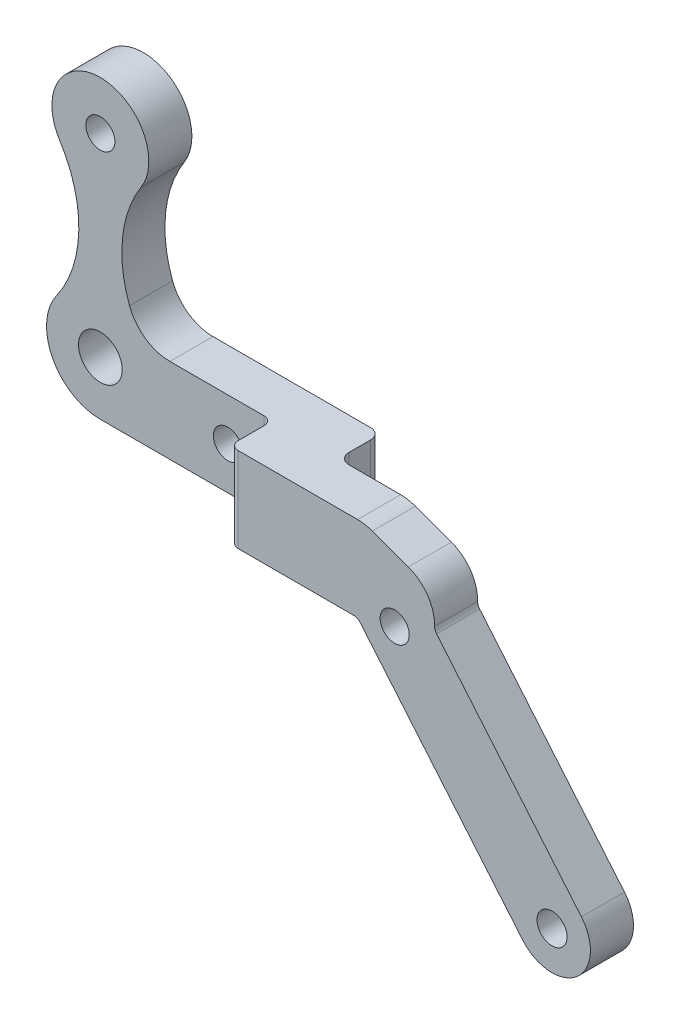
ISO-10303-21;
HEADER;
FILE_DESCRIPTION(('STEP AP214'),'2;1');
FILE_NAME('part.step','',(''),(''),'','','');
FILE_SCHEMA(('AUTOMOTIVE_DESIGN { 1 0 10303 214 1 1 1 1 }'));
ENDSEC;
DATA;
#1=APPLICATION_CONTEXT('core data for automotive mechanical design processes');
#2=APPLICATION_PROTOCOL_DEFINITION('international standard','automotive_design',2000,#1);
#3=PRODUCT_CONTEXT('',#1,'mechanical');
#4=PRODUCT('Part','Part','',(#3));
#5=PRODUCT_RELATED_PRODUCT_CATEGORY('part','',(#4));
#6=PRODUCT_DEFINITION_FORMATION('','',#4);
#7=PRODUCT_DEFINITION_CONTEXT('part definition',#1,'design');
#8=PRODUCT_DEFINITION('design','',#6,#7);
#9=PRODUCT_DEFINITION_SHAPE('','',#8);
#10=(LENGTH_UNIT() NAMED_UNIT(*) SI_UNIT(.MILLI.,.METRE.));
#11=(NAMED_UNIT(*) PLANE_ANGLE_UNIT() SI_UNIT($,.RADIAN.));
#12=(NAMED_UNIT(*) SI_UNIT($,.STERADIAN.) SOLID_ANGLE_UNIT());
#13=UNCERTAINTY_MEASURE_WITH_UNIT(LENGTH_MEASURE(1.E-05),#10,'distance_accuracy_value','');
#14=(GEOMETRIC_REPRESENTATION_CONTEXT(3) GLOBAL_UNCERTAINTY_ASSIGNED_CONTEXT((#13)) GLOBAL_UNIT_ASSIGNED_CONTEXT((#10,
#11,#12)) REPRESENTATION_CONTEXT('',''));
#15=CARTESIAN_POINT('',(0.,0.,0.));
#16=DIRECTION('',(0.,0.,1.));
#17=DIRECTION('',(1.,0.,0.));
#18=AXIS2_PLACEMENT_3D('',#15,#16,#17);
#19=CARTESIAN_POINT('',(16.9667619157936,11.9984192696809,7.62));
#20=DIRECTION('',(0.,0.,-1.));
#21=DIRECTION('',(1.,0.,0.));
#22=AXIS2_PLACEMENT_3D('',#19,#20,#21);
#23=PLANE('',#22);
#24=CARTESIAN_POINT('',(0.,0.,7.62));
#25=DIRECTION('',(0.,0.,1.));
#26=DIRECTION('',(1.,0.,0.));
#27=AXIS2_PLACEMENT_3D('',#24,#25,#26);
#28=CIRCLE('',#27,2.5781);
#29=CARTESIAN_POINT('',(2.5781,0.,7.62));
#30=VERTEX_POINT('',#29);
#31=EDGE_CURVE('E227',#30,#30,#28,.T.);
#32=ORIENTED_EDGE('',*,*,#31,.F.);
#33=EDGE_LOOP('',(#32));
#34=FACE_BOUND('',#33,.T.);
#35=CARTESIAN_POINT('',(15.042758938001,-1.34180015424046,7.62));
#36=DIRECTION('',(0.,0.,1.));
#37=DIRECTION('',(1.,0.,0.));
#38=AXIS2_PLACEMENT_3D('',#35,#36,#37);
#39=CIRCLE('',#38,1.7145);
#40=CARTESIAN_POINT('',(16.757258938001,-1.34180015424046,7.62));
#41=VERTEX_POINT('',#40);
#42=EDGE_CURVE('E234',#41,#41,#39,.T.);
#43=ORIENTED_EDGE('',*,*,#42,.F.);
#44=EDGE_LOOP('',(#43));
#45=FACE_BOUND('',#44,.T.);
#46=CARTESIAN_POINT('',(0.,22.86,7.62));
#47=DIRECTION('',(0.,0.,1.));
#48=DIRECTION('',(1.,0.,0.));
#49=AXIS2_PLACEMENT_3D('',#46,#47,#48);
#50=CIRCLE('',#49,1.7145);
#51=CARTESIAN_POINT('',(1.7145,22.86,7.62));
#52=VERTEX_POINT('',#51);
#53=EDGE_CURVE('E271',#52,#52,#50,.T.);
#54=ORIENTED_EDGE('',*,*,#53,.F.);
#55=EDGE_LOOP('',(#54));
#56=FACE_BOUND('',#55,.T.);
#57=DIRECTION('',(-1.,0.,0.));
#58=VECTOR('',#57,1.);
#59=CARTESIAN_POINT('',(5.18459384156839,3.66639969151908,7.62));
#60=LINE('',#59,#58);
#61=CARTESIAN_POINT('',(19.304,3.66639969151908,7.62));
#62=VERTEX_POINT('',#61);
#63=CARTESIAN_POINT('',(8.19989409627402,3.66639969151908,7.62));
#64=VERTEX_POINT('',#63);
#65=EDGE_CURVE('E281',#62,#64,#60,.T.);
#66=ORIENTED_EDGE('',*,*,#65,.T.);
#67=CARTESIAN_POINT('',(8.19989409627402,8.74639969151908,7.62));
#68=DIRECTION('',(0.,0.,1.));
#69=DIRECTION('',(1.,0.,0.));
#70=AXIS2_PLACEMENT_3D('',#67,#68,#69);
#71=CIRCLE('',#70,5.08);
#72=CARTESIAN_POINT('',(3.43702128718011,6.97963920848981,7.62));
#73=VERTEX_POINT('',#72);
#74=EDGE_CURVE('E330',#73,#64,#71,.T.);
#75=ORIENTED_EDGE('',*,*,#74,.F.);
#76=CARTESIAN_POINT('',(16.9667619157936,11.9984192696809,7.62));
#77=DIRECTION('',(0.,0.,-1.));
#78=DIRECTION('',(1.,0.,0.));
#79=AXIS2_PLACEMENT_3D('',#76,#77,#78);
#80=CIRCLE('',#79,14.4305937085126);
#81=CARTESIAN_POINT('',(4.81321353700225,19.77873395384,7.62));
#82=VERTEX_POINT('',#81);
#83=EDGE_CURVE('E274',#73,#82,#80,.T.);
#84=ORIENTED_EDGE('',*,*,#83,.T.);
#85=CARTESIAN_POINT('',(0.,22.86,7.62));
#86=DIRECTION('',(0.,0.,1.));
#87=DIRECTION('',(1.,0.,0.));
#88=AXIS2_PLACEMENT_3D('',#85,#86,#87);
#89=CIRCLE('',#88,5.715);
#90=CARTESIAN_POINT('',(-4.81321353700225,19.77873395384,7.62));
#91=VERTEX_POINT('',#90);
#92=EDGE_CURVE('E298',#82,#91,#89,.T.);
#93=ORIENTED_EDGE('',*,*,#92,.T.);
#94=CARTESIAN_POINT('',(-16.9667619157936,11.9984192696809,7.62));
#95=DIRECTION('',(0.,0.,-1.));
#96=DIRECTION('',(-1.,0.,0.));
#97=AXIS2_PLACEMENT_3D('',#94,#95,#96);
#98=CIRCLE('',#97,14.4305937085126);
#99=CARTESIAN_POINT('',(-5.18459384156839,3.66639969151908,7.62));
#100=VERTEX_POINT('',#99);
#101=EDGE_CURVE('E301',#91,#100,#98,.T.);
#102=ORIENTED_EDGE('',*,*,#101,.T.);
#103=CARTESIAN_POINT('',(0.,0.,7.62));
#104=DIRECTION('',(0.,0.,1.));
#105=DIRECTION('',(1.,0.,0.));
#106=AXIS2_PLACEMENT_3D('',#103,#104,#105);
#107=CIRCLE('',#106,6.35);
#108=CARTESIAN_POINT('',(0.,-6.35,7.62));
#109=VERTEX_POINT('',#108);
#110=EDGE_CURVE('E304',#100,#109,#107,.T.);
#111=ORIENTED_EDGE('',*,*,#110,.T.);
#112=DIRECTION('',(1.,0.,0.));
#113=VECTOR('',#112,1.);
#114=CARTESIAN_POINT('',(36.322,-6.35,7.62));
#115=LINE('',#114,#113);
#116=CARTESIAN_POINT('',(19.304,-6.35,7.62));
#117=VERTEX_POINT('',#116);
#118=EDGE_CURVE('E307',#109,#117,#115,.T.);
#119=ORIENTED_EDGE('',*,*,#118,.T.);
#120=DIRECTION('',(0.,-1.,0.));
#121=VECTOR('',#120,1.);
#122=CARTESIAN_POINT('',(19.304,11.9984192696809,7.62));
#123=LINE('',#122,#121);
#124=EDGE_CURVE('E347',#62,#117,#123,.T.);
#125=ORIENTED_EDGE('',*,*,#124,.F.);
#126=EDGE_LOOP('',(#66,#75,#84,#93,#102,#111,#119,#125));
#127=FACE_BOUND('',#126,.T.);
#128=ADVANCED_FACE('F35',(#34,#45,#56,#127),#23,.F.);
#129=CARTESIAN_POINT('',(16.9667619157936,11.9984192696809,2.54));
#130=DIRECTION('',(0.,0.,1.));
#131=DIRECTION('',(-1.,0.,0.));
#132=AXIS2_PLACEMENT_3D('',#129,#130,#131);
#133=CYLINDRICAL_SURFACE('',#132,14.4305937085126);
#134=CARTESIAN_POINT('',(16.9667619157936,11.9984192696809,2.54));
#135=DIRECTION('',(0.,0.,-1.));
#136=DIRECTION('',(1.,0.,0.));
#137=AXIS2_PLACEMENT_3D('',#134,#135,#136);
#138=CIRCLE('',#137,14.4305937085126);
#139=CARTESIAN_POINT('',(3.43702128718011,6.97963920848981,2.54));
#140=VERTEX_POINT('',#139);
#141=CARTESIAN_POINT('',(4.81321353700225,19.77873395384,2.54));
#142=VERTEX_POINT('',#141);
#143=EDGE_CURVE('E277',#140,#142,#138,.T.);
#144=ORIENTED_EDGE('',*,*,#143,.T.);
#145=DIRECTION('',(0.,0.,1.));
#146=VECTOR('',#145,1.);
#147=CARTESIAN_POINT('',(4.81321353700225,19.77873395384,2.54));
#148=LINE('',#147,#146);
#149=EDGE_CURVE('E317',#142,#82,#148,.T.);
#150=ORIENTED_EDGE('',*,*,#149,.T.);
#151=ORIENTED_EDGE('',*,*,#83,.F.);
#152=DIRECTION('',(0.,0.,1.));
#153=VECTOR('',#152,1.);
#154=CARTESIAN_POINT('',(3.4370212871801,6.97963920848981,2.54));
#155=LINE('',#154,#153);
#156=EDGE_CURVE('E319',#140,#73,#155,.T.);
#157=ORIENTED_EDGE('',*,*,#156,.F.);
#158=EDGE_LOOP('',(#144,#150,#151,#157));
#159=FACE_BOUND('',#158,.T.);
#160=ADVANCED_FACE('F458',(#159),#133,.F.);
#161=CARTESIAN_POINT('',(0.,22.86,2.54));
#162=DIRECTION('',(0.,0.,1.));
#163=DIRECTION('',(-1.,0.,0.));
#164=AXIS2_PLACEMENT_3D('',#161,#162,#163);
#165=CYLINDRICAL_SURFACE('',#164,5.715);
#166=ORIENTED_EDGE('',*,*,#92,.F.);
#167=ORIENTED_EDGE('',*,*,#149,.F.);
#168=CARTESIAN_POINT('',(0.,22.86,2.54));
#169=DIRECTION('',(0.,0.,1.));
#170=DIRECTION('',(1.,0.,0.));
#171=AXIS2_PLACEMENT_3D('',#168,#169,#170);
#172=CIRCLE('',#171,5.715);
#173=CARTESIAN_POINT('',(-4.81321353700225,19.77873395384,2.54));
#174=VERTEX_POINT('',#173);
#175=EDGE_CURVE('E280',#142,#174,#172,.T.);
#176=ORIENTED_EDGE('',*,*,#175,.T.);
#177=DIRECTION('',(0.,0.,1.));
#178=VECTOR('',#177,1.);
#179=CARTESIAN_POINT('',(-4.81321353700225,19.77873395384,2.54));
#180=LINE('',#179,#178);
#181=EDGE_CURVE('E315',#174,#91,#180,.T.);
#182=ORIENTED_EDGE('',*,*,#181,.T.);
#183=EDGE_LOOP('',(#166,#167,#176,#182));
#184=FACE_BOUND('',#183,.T.);
#185=ADVANCED_FACE('F464',(#184),#165,.T.);
#186=CARTESIAN_POINT('',(-16.9667619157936,11.9984192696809,2.54));
#187=DIRECTION('',(0.,0.,1.));
#188=DIRECTION('',(-1.,0.,0.));
#189=AXIS2_PLACEMENT_3D('',#186,#187,#188);
#190=CYLINDRICAL_SURFACE('',#189,14.4305937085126);
#191=ORIENTED_EDGE('',*,*,#101,.F.);
#192=ORIENTED_EDGE('',*,*,#181,.F.);
#193=CARTESIAN_POINT('',(-16.9667619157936,11.9984192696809,2.54));
#194=DIRECTION('',(0.,0.,-1.));
#195=DIRECTION('',(-1.,0.,0.));
#196=AXIS2_PLACEMENT_3D('',#193,#194,#195);
#197=CIRCLE('',#196,14.4305937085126);
#198=CARTESIAN_POINT('',(-5.18459384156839,3.66639969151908,2.54));
#199=VERTEX_POINT('',#198);
#200=EDGE_CURVE('E284',#174,#199,#197,.T.);
#201=ORIENTED_EDGE('',*,*,#200,.T.);
#202=DIRECTION('',(0.,0.,1.));
#203=VECTOR('',#202,1.);
#204=CARTESIAN_POINT('',(-5.18459384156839,3.66639969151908,2.54));
#205=LINE('',#204,#203);
#206=EDGE_CURVE('E313',#199,#100,#205,.T.);
#207=ORIENTED_EDGE('',*,*,#206,.T.);
#208=EDGE_LOOP('',(#191,#192,#201,#207));
#209=FACE_BOUND('',#208,.T.);
#210=ADVANCED_FACE('F482',(#209),#190,.F.);
#211=CARTESIAN_POINT('',(0.,0.,2.54));
#212=DIRECTION('',(0.,0.,1.));
#213=DIRECTION('',(-1.,0.,0.));
#214=AXIS2_PLACEMENT_3D('',#211,#212,#213);
#215=CYLINDRICAL_SURFACE('',#214,6.35);
#216=ORIENTED_EDGE('',*,*,#110,.F.);
#217=ORIENTED_EDGE('',*,*,#206,.F.);
#218=CARTESIAN_POINT('',(0.,0.,2.54));
#219=DIRECTION('',(0.,0.,1.));
#220=DIRECTION('',(1.,0.,0.));
#221=AXIS2_PLACEMENT_3D('',#218,#219,#220);
#222=CIRCLE('',#221,6.35);
#223=CARTESIAN_POINT('',(0.,-6.35,2.54));
#224=VERTEX_POINT('',#223);
#225=EDGE_CURVE('E287',#199,#224,#222,.T.);
#226=ORIENTED_EDGE('',*,*,#225,.T.);
#227=DIRECTION('',(0.,0.,1.));
#228=VECTOR('',#227,1.);
#229=CARTESIAN_POINT('',(0.,-6.35,2.54));
#230=LINE('',#229,#228);
#231=EDGE_CURVE('E295',#224,#109,#230,.T.);
#232=ORIENTED_EDGE('',*,*,#231,.T.);
#233=EDGE_LOOP('',(#216,#217,#226,#232));
#234=FACE_BOUND('',#233,.T.);
#235=ADVANCED_FACE('F447',(#234),#215,.T.);
#236=CARTESIAN_POINT('',(36.322,-6.35,2.54));
#237=DIRECTION('',(0.,1.,0.));
#238=DIRECTION('',(-1.,0.,0.));
#239=AXIS2_PLACEMENT_3D('',#236,#237,#238);
#240=PLANE('',#239);
#241=DIRECTION('',(1.,0.,0.));
#242=VECTOR('',#241,1.);
#243=CARTESIAN_POINT('',(36.322,-6.35,2.54));
#244=LINE('',#243,#242);
#245=CARTESIAN_POINT('',(26.790258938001,-6.35,2.54));
#246=VERTEX_POINT('',#245);
#247=EDGE_CURVE('E290',#224,#246,#244,.T.);
#248=ORIENTED_EDGE('',*,*,#247,.T.);
#249=CARTESIAN_POINT('',(26.790258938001,-6.34999999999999,3.81));
#250=DIRECTION('',(0.,1.,0.));
#251=DIRECTION('',(-1.,0.,0.));
#252=AXIS2_PLACEMENT_3D('',#249,#250,#251);
#253=CIRCLE('',#252,1.27);
#254=CARTESIAN_POINT('',(28.060258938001,-6.35,3.81));
#255=VERTEX_POINT('',#254);
#256=EDGE_CURVE('E58',#246,#255,#253,.F.);
#257=ORIENTED_EDGE('',*,*,#256,.T.);
#258=DIRECTION('',(0.,0.,-1.));
#259=VECTOR('',#258,1.);
#260=CARTESIAN_POINT('',(28.060258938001,-6.35,18.8509689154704));
#261=LINE('',#260,#259);
#262=CARTESIAN_POINT('',(28.060258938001,-6.35,6.35));
#263=VERTEX_POINT('',#262);
#264=EDGE_CURVE('E391',#263,#255,#261,.T.);
#265=ORIENTED_EDGE('',*,*,#264,.F.);
#266=CARTESIAN_POINT('',(29.330258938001,-6.35,6.35));
#267=DIRECTION('',(0.,1.,0.));
#268=DIRECTION('',(-1.,0.,0.));
#269=AXIS2_PLACEMENT_3D('',#266,#267,#268);
#270=CIRCLE('',#269,1.27);
#271=CARTESIAN_POINT('',(29.330258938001,-6.35,7.62));
#272=VERTEX_POINT('',#271);
#273=EDGE_CURVE('E43',#263,#272,#270,.T.);
#274=ORIENTED_EDGE('',*,*,#273,.T.);
#275=DIRECTION('',(-1.,0.,0.));
#276=VECTOR('',#275,1.);
#277=CARTESIAN_POINT('',(23.996258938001,-6.34999999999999,7.62));
#278=LINE('',#277,#276);
#279=CARTESIAN_POINT('',(34.9524903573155,-6.35,7.62));
#280=VERTEX_POINT('',#279);
#281=EDGE_CURVE('E250',#280,#272,#278,.T.);
#282=ORIENTED_EDGE('',*,*,#281,.F.);
#283=DIRECTION('',(0.,0.,-1.));
#284=VECTOR('',#283,1.);
#285=CARTESIAN_POINT('',(34.9524903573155,-6.35,2.54));
#286=LINE('',#285,#284);
#287=CARTESIAN_POINT('',(34.9524903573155,-6.35,12.7));
#288=VERTEX_POINT('',#287);
#289=EDGE_CURVE('E365',#280,#288,#286,.F.);
#290=ORIENTED_EDGE('',*,*,#289,.T.);
#291=DIRECTION('',(1.,0.,0.));
#292=VECTOR('',#291,1.);
#293=CARTESIAN_POINT('',(20.32,-6.35,12.7));
#294=LINE('',#293,#292);
#295=CARTESIAN_POINT('',(21.336,-6.35,12.7));
#296=VERTEX_POINT('',#295);
#297=EDGE_CURVE('E259',#296,#288,#294,.T.);
#298=ORIENTED_EDGE('',*,*,#297,.F.);
#299=CARTESIAN_POINT('',(21.336,-6.35,11.684));
#300=DIRECTION('',(0.,-1.,0.));
#301=DIRECTION('',(-1.,0.,0.));
#302=AXIS2_PLACEMENT_3D('',#299,#300,#301);
#303=CIRCLE('',#302,1.016);
#304=CARTESIAN_POINT('',(20.32,-6.35,11.684));
#305=VERTEX_POINT('',#304);
#306=EDGE_CURVE('E338',#305,#296,#303,.F.);
#307=ORIENTED_EDGE('',*,*,#306,.F.);
#308=DIRECTION('',(0.,0.,-1.));
#309=VECTOR('',#308,1.);
#310=CARTESIAN_POINT('',(20.32,-6.35,12.7));
#311=LINE('',#310,#309);
#312=CARTESIAN_POINT('',(20.32,-6.35,8.636));
#313=VERTEX_POINT('',#312);
#314=EDGE_CURVE('E264',#305,#313,#311,.T.);
#315=ORIENTED_EDGE('',*,*,#314,.T.);
#316=CARTESIAN_POINT('',(19.304,-6.34999999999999,8.636));
#317=DIRECTION('',(0.,-1.,0.));
#318=DIRECTION('',(-1.,0.,0.));
#319=AXIS2_PLACEMENT_3D('',#316,#317,#318);
#320=CIRCLE('',#319,1.016);
#321=EDGE_CURVE('E350',#117,#313,#320,.T.);
#322=ORIENTED_EDGE('',*,*,#321,.F.);
#323=ORIENTED_EDGE('',*,*,#118,.F.);
#324=ORIENTED_EDGE('',*,*,#231,.F.);
#325=EDGE_LOOP('',(#248,#257,#265,#274,#282,#290,#298,#307,#315,#322,#323,#324));
#326=FACE_BOUND('',#325,.T.);
#327=ADVANCED_FACE('F388',(#326),#240,.F.);
#328=CARTESIAN_POINT('',(36.322,3.66639969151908,2.54));
#329=DIRECTION('',(-0.34202014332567,-0.939692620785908,0.));
#330=DIRECTION('',(0.939692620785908,-0.34202014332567,0.));
#331=AXIS2_PLACEMENT_3D('',#328,#329,#330);
#332=PLANE('',#331);
#333=DIRECTION('',(0.,0.,1.));
#334=VECTOR('',#333,1.);
#335=CARTESIAN_POINT('',(41.4054965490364,1.81615826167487,2.54));
#336=LINE('',#335,#334);
#337=CARTESIAN_POINT('',(41.4054965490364,1.81615826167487,7.62));
#338=VERTEX_POINT('',#337);
#339=CARTESIAN_POINT('',(41.4054965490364,1.81615826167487,12.7));
#340=VERTEX_POINT('',#339);
#341=EDGE_CURVE('E240',#338,#340,#336,.T.);
#342=ORIENTED_EDGE('',*,*,#341,.F.);
#343=DIRECTION('',(0.939692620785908,-0.34202014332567,0.));
#344=VECTOR('',#343,1.);
#345=CARTESIAN_POINT('',(58.1132313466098,-4.26495988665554,7.62));
#346=LINE('',#345,#344);
#347=CARTESIAN_POINT('',(37.1637212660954,3.36003820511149,7.62));
#348=VERTEX_POINT('',#347);
#349=EDGE_CURVE('E247',#348,#338,#346,.T.);
#350=ORIENTED_EDGE('',*,*,#349,.F.);
#351=DIRECTION('',(0.,0.,1.));
#352=VECTOR('',#351,1.);
#353=CARTESIAN_POINT('',(37.1637212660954,3.36003820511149,2.54));
#354=LINE('',#353,#352);
#355=CARTESIAN_POINT('',(37.1637212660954,3.36003820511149,12.7));
#356=VERTEX_POINT('',#355);
#357=EDGE_CURVE('E327',#356,#348,#354,.F.);
#358=ORIENTED_EDGE('',*,*,#357,.F.);
#359=DIRECTION('',(0.939692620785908,-0.34202014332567,0.));
#360=VECTOR('',#359,1.);
#361=CARTESIAN_POINT('',(37.1637212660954,3.36003820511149,12.7));
#362=LINE('',#361,#360);
#363=EDGE_CURVE('E257',#356,#340,#362,.T.);
#364=ORIENTED_EDGE('',*,*,#363,.T.);
#365=EDGE_LOOP('',(#342,#350,#358,#364));
#366=FACE_BOUND('',#365,.T.);
#367=ADVANCED_FACE('F474',(#366),#332,.F.);
#368=CARTESIAN_POINT('',(5.18459384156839,3.66639969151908,2.54));
#369=DIRECTION('',(0.,-1.,0.));
#370=DIRECTION('',(0.,0.,1.));
#371=AXIS2_PLACEMENT_3D('',#368,#369,#370);
#372=PLANE('',#371);
#373=DIRECTION('',(0.,0.,-1.));
#374=VECTOR('',#373,1.);
#375=CARTESIAN_POINT('',(28.060258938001,3.66639969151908,18.8509689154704));
#376=LINE('',#375,#374);
#377=CARTESIAN_POINT('',(28.060258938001,3.66639969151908,6.35));
#378=VERTEX_POINT('',#377);
#379=CARTESIAN_POINT('',(28.060258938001,3.66639969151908,3.81));
#380=VERTEX_POINT('',#379);
#381=EDGE_CURVE('E404',#378,#380,#376,.T.);
#382=ORIENTED_EDGE('',*,*,#381,.T.);
#383=CARTESIAN_POINT('',(26.790258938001,3.66639969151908,3.81));
#384=DIRECTION('',(0.,-1.,0.));
#385=DIRECTION('',(0.,0.,-1.));
#386=AXIS2_PLACEMENT_3D('',#383,#384,#385);
#387=CIRCLE('',#386,1.27);
#388=CARTESIAN_POINT('',(26.790258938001,3.66639969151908,2.54));
#389=VERTEX_POINT('',#388);
#390=EDGE_CURVE('E50',#380,#389,#387,.F.);
#391=ORIENTED_EDGE('',*,*,#390,.T.);
#392=DIRECTION('',(-1.,0.,0.));
#393=VECTOR('',#392,1.);
#394=CARTESIAN_POINT('',(5.18459384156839,3.66639969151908,2.54));
#395=LINE('',#394,#393);
#396=CARTESIAN_POINT('',(8.19989409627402,3.66639969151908,2.54));
#397=VERTEX_POINT('',#396);
#398=EDGE_CURVE('E293',#389,#397,#395,.T.);
#399=ORIENTED_EDGE('',*,*,#398,.T.);
#400=DIRECTION('',(0.,0.,-1.));
#401=VECTOR('',#400,1.);
#402=CARTESIAN_POINT('',(8.19989409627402,3.66639969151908,2.54));
#403=LINE('',#402,#401);
#404=EDGE_CURVE('E324',#64,#397,#403,.T.);
#405=ORIENTED_EDGE('',*,*,#404,.F.);
#406=ORIENTED_EDGE('',*,*,#65,.F.);
#407=CARTESIAN_POINT('',(19.304,3.66639969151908,8.636));
#408=DIRECTION('',(0.,1.,0.));
#409=DIRECTION('',(0.,0.,1.));
#410=AXIS2_PLACEMENT_3D('',#407,#408,#409);
#411=CIRCLE('',#410,1.016);
#412=CARTESIAN_POINT('',(20.32,3.66639969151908,8.636));
#413=VERTEX_POINT('',#412);
#414=EDGE_CURVE('E353',#413,#62,#411,.T.);
#415=ORIENTED_EDGE('',*,*,#414,.F.);
#416=DIRECTION('',(0.,0.,-1.));
#417=VECTOR('',#416,1.);
#418=CARTESIAN_POINT('',(20.32,3.66639969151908,12.7));
#419=LINE('',#418,#417);
#420=CARTESIAN_POINT('',(20.32,3.66639969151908,11.684));
#421=VERTEX_POINT('',#420);
#422=EDGE_CURVE('E265',#421,#413,#419,.T.);
#423=ORIENTED_EDGE('',*,*,#422,.F.);
#424=CARTESIAN_POINT('',(21.336,3.66639969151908,11.684));
#425=DIRECTION('',(0.,1.,0.));
#426=DIRECTION('',(0.,0.,1.));
#427=AXIS2_PLACEMENT_3D('',#424,#425,#426);
#428=CIRCLE('',#427,1.016);
#429=CARTESIAN_POINT('',(21.336,3.66639969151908,12.7));
#430=VERTEX_POINT('',#429);
#431=EDGE_CURVE('E335',#430,#421,#428,.F.);
#432=ORIENTED_EDGE('',*,*,#431,.F.);
#433=DIRECTION('',(-1.,0.,0.));
#434=VECTOR('',#433,1.);
#435=CARTESIAN_POINT('',(20.32,3.66639969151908,12.7));
#436=LINE('',#435,#434);
#437=CARTESIAN_POINT('',(35.426258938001,3.66639969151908,12.7));
#438=VERTEX_POINT('',#437);
#439=EDGE_CURVE('E261',#438,#430,#436,.T.);
#440=ORIENTED_EDGE('',*,*,#439,.F.);
#441=DIRECTION('',(0.,0.,1.));
#442=VECTOR('',#441,1.);
#443=CARTESIAN_POINT('',(35.426258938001,3.66639969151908,2.54));
#444=LINE('',#443,#442);
#445=CARTESIAN_POINT('',(35.426258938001,3.66639969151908,7.62));
#446=VERTEX_POINT('',#445);
#447=EDGE_CURVE('E321',#446,#438,#444,.T.);
#448=ORIENTED_EDGE('',*,*,#447,.F.);
#449=DIRECTION('',(1.,0.,0.));
#450=VECTOR('',#449,1.);
#451=CARTESIAN_POINT('',(35.426258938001,3.66639969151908,7.62));
#452=LINE('',#451,#450);
#453=CARTESIAN_POINT('',(29.330258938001,3.66639969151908,7.62));
#454=VERTEX_POINT('',#453);
#455=EDGE_CURVE('E253',#454,#446,#452,.T.);
#456=ORIENTED_EDGE('',*,*,#455,.F.);
#457=CARTESIAN_POINT('',(29.330258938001,3.66639969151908,6.35));
#458=DIRECTION('',(0.,-1.,0.));
#459=DIRECTION('',(0.,0.,-1.));
#460=AXIS2_PLACEMENT_3D('',#457,#458,#459);
#461=CIRCLE('',#460,1.27);
#462=EDGE_CURVE('E11',#454,#378,#461,.T.);
#463=ORIENTED_EDGE('',*,*,#462,.T.);
#464=EDGE_LOOP('',(#382,#391,#399,#405,#406,#415,#423,#432,#440,#448,#456,#463));
#465=FACE_BOUND('',#464,.T.);
#466=ADVANCED_FACE('F403',(#465),#372,.F.);
#467=CARTESIAN_POINT('',(16.9667619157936,11.9984192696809,2.54));
#468=DIRECTION('',(0.,0.,-1.));
#469=DIRECTION('',(1.,0.,0.));
#470=AXIS2_PLACEMENT_3D('',#467,#468,#469);
#471=PLANE('',#470);
#472=CARTESIAN_POINT('',(0.,0.,2.54));
#473=DIRECTION('',(0.,0.,1.));
#474=DIRECTION('',(1.,0.,0.));
#475=AXIS2_PLACEMENT_3D('',#472,#473,#474);
#476=CIRCLE('',#475,2.5781);
#477=CARTESIAN_POINT('',(2.5781,0.,2.54));
#478=VERTEX_POINT('',#477);
#479=EDGE_CURVE('E224',#478,#478,#476,.T.);
#480=ORIENTED_EDGE('',*,*,#479,.T.);
#481=EDGE_LOOP('',(#480));
#482=FACE_BOUND('',#481,.T.);
#483=CARTESIAN_POINT('',(15.042758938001,-1.34180015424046,2.54));
#484=DIRECTION('',(0.,0.,1.));
#485=DIRECTION('',(1.,0.,0.));
#486=AXIS2_PLACEMENT_3D('',#483,#484,#485);
#487=CIRCLE('',#486,1.7145);
#488=CARTESIAN_POINT('',(16.757258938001,-1.34180015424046,2.54));
#489=VERTEX_POINT('',#488);
#490=EDGE_CURVE('E231',#489,#489,#487,.T.);
#491=ORIENTED_EDGE('',*,*,#490,.T.);
#492=EDGE_LOOP('',(#491));
#493=FACE_BOUND('',#492,.T.);
#494=ORIENTED_EDGE('',*,*,#398,.F.);
#495=DIRECTION('',(0.,-1.,0.));
#496=VECTOR('',#495,1.);
#497=CARTESIAN_POINT('',(26.790258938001,11.9984192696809,2.54));
#498=LINE('',#497,#496);
#499=EDGE_CURVE('E382',#389,#246,#498,.T.);
#500=ORIENTED_EDGE('',*,*,#499,.T.);
#501=ORIENTED_EDGE('',*,*,#247,.F.);
#502=ORIENTED_EDGE('',*,*,#225,.F.);
#503=ORIENTED_EDGE('',*,*,#200,.F.);
#504=ORIENTED_EDGE('',*,*,#175,.F.);
#505=ORIENTED_EDGE('',*,*,#143,.F.);
#506=CARTESIAN_POINT('',(8.19989409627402,8.74639969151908,2.54));
#507=DIRECTION('',(0.,0.,1.));
#508=DIRECTION('',(1.,0.,0.));
#509=AXIS2_PLACEMENT_3D('',#506,#507,#508);
#510=CIRCLE('',#509,5.08);
#511=EDGE_CURVE('E333',#397,#140,#510,.F.);
#512=ORIENTED_EDGE('',*,*,#511,.F.);
#513=EDGE_LOOP('',(#494,#500,#501,#502,#503,#504,#505,#512));
#514=FACE_BOUND('',#513,.T.);
#515=CARTESIAN_POINT('',(0.,22.86,2.54));
#516=DIRECTION('',(0.,0.,1.));
#517=DIRECTION('',(1.,0.,0.));
#518=AXIS2_PLACEMENT_3D('',#515,#516,#517);
#519=CIRCLE('',#518,1.7145);
#520=CARTESIAN_POINT('',(1.7145,22.86,2.54));
#521=VERTEX_POINT('',#520);
#522=EDGE_CURVE('E268',#521,#521,#519,.T.);
#523=ORIENTED_EDGE('',*,*,#522,.T.);
#524=EDGE_LOOP('',(#523));
#525=FACE_BOUND('',#524,.T.);
#526=ADVANCED_FACE('F449',(#482,#493,#514,#525),#471,.T.);
#527=CARTESIAN_POINT('',(8.19989409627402,8.74639969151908,2.54));
#528=DIRECTION('',(0.,0.,1.));
#529=DIRECTION('',(-1.,0.,0.));
#530=AXIS2_PLACEMENT_3D('',#527,#528,#529);
#531=CYLINDRICAL_SURFACE('',#530,5.08);
#532=ORIENTED_EDGE('',*,*,#511,.T.);
#533=ORIENTED_EDGE('',*,*,#156,.T.);
#534=ORIENTED_EDGE('',*,*,#74,.T.);
#535=ORIENTED_EDGE('',*,*,#404,.T.);
#536=EDGE_LOOP('',(#532,#533,#534,#535));
#537=FACE_BOUND('',#536,.T.);
#538=ADVANCED_FACE('F489',(#537),#531,.F.);
#539=CARTESIAN_POINT('',(35.426258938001,-1.41360030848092,2.54));
#540=DIRECTION('',(0.,0.,1.));
#541=DIRECTION('',(-1.,0.,0.));
#542=AXIS2_PLACEMENT_3D('',#539,#540,#541);
#543=CYLINDRICAL_SURFACE('',#542,5.08);
#544=CARTESIAN_POINT('',(35.426258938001,-1.41360030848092,7.62));
#545=DIRECTION('',(0.,0.,-1.));
#546=DIRECTION('',(-1.,0.,0.));
#547=AXIS2_PLACEMENT_3D('',#544,#545,#546);
#548=CIRCLE('',#547,5.08);
#549=EDGE_CURVE('E245',#446,#348,#548,.T.);
#550=ORIENTED_EDGE('',*,*,#549,.F.);
#551=ORIENTED_EDGE('',*,*,#447,.T.);
#552=CARTESIAN_POINT('',(35.426258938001,-1.41360030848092,12.7));
#553=DIRECTION('',(0.,0.,-1.));
#554=DIRECTION('',(-1.,0.,0.));
#555=AXIS2_PLACEMENT_3D('',#552,#553,#554);
#556=CIRCLE('',#555,5.08);
#557=EDGE_CURVE('E255',#438,#356,#556,.T.);
#558=ORIENTED_EDGE('',*,*,#557,.T.);
#559=ORIENTED_EDGE('',*,*,#357,.T.);
#560=EDGE_LOOP('',(#550,#551,#558,#559));
#561=FACE_BOUND('',#560,.T.);
#562=ADVANCED_FACE('F492',(#561),#543,.T.);
#563=CARTESIAN_POINT('',(0.,22.86,7.62));
#564=DIRECTION('',(0.,0.,-1.));
#565=DIRECTION('',(1.,0.,0.));
#566=AXIS2_PLACEMENT_3D('',#563,#564,#565);
#567=CYLINDRICAL_SURFACE('',#566,1.7145);
#568=ORIENTED_EDGE('',*,*,#53,.T.);
#569=EDGE_LOOP('',(#568));
#570=FACE_BOUND('',#569,.T.);
#571=ORIENTED_EDGE('',*,*,#522,.F.);
#572=EDGE_LOOP('',(#571));
#573=FACE_BOUND('',#572,.T.);
#574=ADVANCED_FACE('F496',(#570,#573),#567,.F.);
#575=CARTESIAN_POINT('',(20.32,-6.35,12.7));
#576=DIRECTION('',(-1.,0.,0.));
#577=DIRECTION('',(0.,0.,-1.));
#578=AXIS2_PLACEMENT_3D('',#575,#576,#577);
#579=PLANE('',#578);
#580=ORIENTED_EDGE('',*,*,#422,.T.);
#581=DIRECTION('',(0.,-1.,0.));
#582=VECTOR('',#581,1.);
#583=CARTESIAN_POINT('',(20.32,-6.35,8.636));
#584=LINE('',#583,#582);
#585=EDGE_CURVE('E341',#313,#413,#584,.F.);
#586=ORIENTED_EDGE('',*,*,#585,.F.);
#587=ORIENTED_EDGE('',*,*,#314,.F.);
#588=DIRECTION('',(0.,-1.,0.));
#589=VECTOR('',#588,1.);
#590=CARTESIAN_POINT('',(20.32,-6.35,11.684));
#591=LINE('',#590,#589);
#592=EDGE_CURVE('E343',#421,#305,#591,.T.);
#593=ORIENTED_EDGE('',*,*,#592,.F.);
#594=EDGE_LOOP('',(#580,#586,#587,#593));
#595=FACE_BOUND('',#594,.T.);
#596=ADVANCED_FACE('F435',(#595),#579,.T.);
#597=CARTESIAN_POINT('',(0.,0.,12.7));
#598=DIRECTION('',(0.,0.,1.));
#599=DIRECTION('',(-1.,0.,0.));
#600=AXIS2_PLACEMENT_3D('',#597,#598,#599);
#601=PLANE('',#600);
#602=CARTESIAN_POINT('',(39.7958921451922,-5.08,12.7));
#603=DIRECTION('',(0.,0.,-1.));
#604=DIRECTION('',(-1.,0.,0.));
#605=AXIS2_PLACEMENT_3D('',#602,#603,#604);
#606=CIRCLE('',#605,1.7145);
#607=CARTESIAN_POINT('',(38.0813921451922,-5.08,12.7));
#608=VERTEX_POINT('',#607);
#609=EDGE_CURVE('E358',#608,#608,#606,.T.);
#610=ORIENTED_EDGE('',*,*,#609,.T.);
#611=EDGE_LOOP('',(#610));
#612=FACE_BOUND('',#611,.T.);
#613=ORIENTED_EDGE('',*,*,#297,.T.);
#614=CARTESIAN_POINT('',(34.9524903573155,-7.366,12.7));
#615=DIRECTION('',(0.,0.,1.));
#616=DIRECTION('',(1.,0.,0.));
#617=AXIS2_PLACEMENT_3D('',#614,#615,#616);
#618=CIRCLE('',#617,1.016);
#619=CARTESIAN_POINT('',(35.7307915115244,-6.71292778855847,12.7));
#620=VERTEX_POINT('',#619);
#621=EDGE_CURVE('E373',#288,#620,#618,.F.);
#622=ORIENTED_EDGE('',*,*,#621,.T.);
#623=DIRECTION('',(-0.642787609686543,0.766044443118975,0.));
#624=VECTOR('',#623,1.);
#625=CARTESIAN_POINT('',(35.426258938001,-6.35,12.7));
#626=LINE('',#625,#624);
#627=CARTESIAN_POINT('',(54.8908636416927,-29.5470125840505,12.7));
#628=VERTEX_POINT('',#627);
#629=EDGE_CURVE('E210',#628,#620,#626,.T.);
#630=ORIENTED_EDGE('',*,*,#629,.F.);
#631=CARTESIAN_POINT('',(58.3587527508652,-26.6371081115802,12.7));
#632=DIRECTION('',(0.,0.,1.));
#633=DIRECTION('',(1.,0.,0.));
#634=AXIS2_PLACEMENT_3D('',#631,#632,#633);
#635=CIRCLE('',#634,4.52700772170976);
#636=CARTESIAN_POINT('',(61.8266418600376,-23.7272036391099,12.7));
#637=VERTEX_POINT('',#636);
#638=EDGE_CURVE('E205',#637,#628,#635,.F.);
#639=ORIENTED_EDGE('',*,*,#638,.F.);
#640=DIRECTION('',(0.642787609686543,-0.766044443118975,0.));
#641=VECTOR('',#640,1.);
#642=CARTESIAN_POINT('',(39.9481241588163,2.34659843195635,12.7));
#643=LINE('',#642,#641);
#644=CARTESIAN_POINT('',(44.7388238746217,-3.36273516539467,12.7));
#645=VERTEX_POINT('',#644);
#646=EDGE_CURVE('E192',#645,#637,#643,.T.);
#647=ORIENTED_EDGE('',*,*,#646,.F.);
#648=CARTESIAN_POINT('',(45.5171250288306,-2.70966295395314,12.7));
#649=DIRECTION('',(0.,0.,1.));
#650=DIRECTION('',(1.,0.,0.));
#651=AXIS2_PLACEMENT_3D('',#648,#649,#650);
#652=CIRCLE('',#651,1.016);
#653=CARTESIAN_POINT('',(44.5012911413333,-2.69129142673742,12.7));
#654=VERTEX_POINT('',#653);
#655=EDGE_CURVE('E367',#645,#654,#652,.F.);
#656=ORIENTED_EDGE('',*,*,#655,.T.);
#657=CARTESIAN_POINT('',(39.7958921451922,-2.6061934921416,12.7));
#658=DIRECTION('',(0.,0.,-1.));
#659=DIRECTION('',(-1.,0.,0.));
#660=AXIS2_PLACEMENT_3D('',#657,#658,#659);
#661=CIRCLE('',#660,4.70616843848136);
#662=EDGE_CURVE('E237',#340,#654,#661,.T.);
#663=ORIENTED_EDGE('',*,*,#662,.F.);
#664=ORIENTED_EDGE('',*,*,#363,.F.);
#665=ORIENTED_EDGE('',*,*,#557,.F.);
#666=ORIENTED_EDGE('',*,*,#439,.T.);
#667=DIRECTION('',(0.,-1.,0.));
#668=VECTOR('',#667,1.);
#669=CARTESIAN_POINT('',(21.336,0.,12.7));
#670=LINE('',#669,#668);
#671=EDGE_CURVE('E345',#296,#430,#670,.F.);
#672=ORIENTED_EDGE('',*,*,#671,.F.);
#673=EDGE_LOOP('',(#613,#622,#630,#639,#647,#656,#663,#664,#665,#666,#672));
#674=FACE_BOUND('',#673,.T.);
#675=CARTESIAN_POINT('',(58.3587527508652,-26.6371081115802,12.7));
#676=DIRECTION('',(0.,0.,1.));
#677=DIRECTION('',(1.,0.,0.));
#678=AXIS2_PLACEMENT_3D('',#675,#676,#677);
#679=CIRCLE('',#678,1.778);
#680=CARTESIAN_POINT('',(60.1367527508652,-26.6371081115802,12.7));
#681=VERTEX_POINT('',#680);
#682=EDGE_CURVE('E228',#681,#681,#679,.F.);
#683=ORIENTED_EDGE('',*,*,#682,.T.);
#684=EDGE_LOOP('',(#683));
#685=FACE_BOUND('',#684,.T.);
#686=ADVANCED_FACE('F207',(#612,#674,#685),#601,.T.);
#687=CARTESIAN_POINT('',(35.426258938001,-11.43,7.62));
#688=DIRECTION('',(0.,0.,1.));
#689=DIRECTION('',(-1.,0.,0.));
#690=AXIS2_PLACEMENT_3D('',#687,#688,#689);
#691=PLANE('',#690);
#692=CARTESIAN_POINT('',(39.7958921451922,-5.08,7.62));
#693=DIRECTION('',(0.,0.,1.));
#694=DIRECTION('',(1.,0.,0.));
#695=AXIS2_PLACEMENT_3D('',#692,#693,#694);
#696=CIRCLE('',#695,1.7145);
#697=CARTESIAN_POINT('',(41.5103921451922,-5.08,7.62));
#698=VERTEX_POINT('',#697);
#699=EDGE_CURVE('E355',#698,#698,#696,.T.);
#700=ORIENTED_EDGE('',*,*,#699,.T.);
#701=EDGE_LOOP('',(#700));
#702=FACE_BOUND('',#701,.T.);
#703=ORIENTED_EDGE('',*,*,#281,.T.);
#704=DIRECTION('',(0.,-1.,0.));
#705=VECTOR('',#704,1.);
#706=CARTESIAN_POINT('',(29.330258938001,-11.43,7.62));
#707=LINE('',#706,#705);
#708=EDGE_CURVE('E380',#272,#454,#707,.F.);
#709=ORIENTED_EDGE('',*,*,#708,.T.);
#710=ORIENTED_EDGE('',*,*,#455,.T.);
#711=ORIENTED_EDGE('',*,*,#549,.T.);
#712=ORIENTED_EDGE('',*,*,#349,.T.);
#713=CARTESIAN_POINT('',(39.7958921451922,-2.6061934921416,7.62));
#714=DIRECTION('',(0.,0.,-1.));
#715=DIRECTION('',(-1.,0.,0.));
#716=AXIS2_PLACEMENT_3D('',#713,#714,#715);
#717=CIRCLE('',#716,4.70616843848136);
#718=CARTESIAN_POINT('',(44.5012911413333,-2.69129142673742,7.62));
#719=VERTEX_POINT('',#718);
#720=EDGE_CURVE('E238',#719,#338,#717,.F.);
#721=ORIENTED_EDGE('',*,*,#720,.F.);
#722=CARTESIAN_POINT('',(45.5171250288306,-2.70966295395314,7.62));
#723=DIRECTION('',(0.,0.,1.));
#724=DIRECTION('',(1.,0.,0.));
#725=AXIS2_PLACEMENT_3D('',#722,#723,#724);
#726=CIRCLE('',#725,1.016);
#727=CARTESIAN_POINT('',(44.7388238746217,-3.36273516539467,7.62));
#728=VERTEX_POINT('',#727);
#729=EDGE_CURVE('E369',#719,#728,#726,.T.);
#730=ORIENTED_EDGE('',*,*,#729,.T.);
#731=DIRECTION('',(0.642787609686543,-0.766044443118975,0.));
#732=VECTOR('',#731,1.);
#733=CARTESIAN_POINT('',(39.9481241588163,2.34659843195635,7.62));
#734=LINE('',#733,#732);
#735=CARTESIAN_POINT('',(61.8266418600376,-23.7272036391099,7.62));
#736=VERTEX_POINT('',#735);
#737=EDGE_CURVE('E220',#728,#736,#734,.T.);
#738=ORIENTED_EDGE('',*,*,#737,.T.);
#739=CARTESIAN_POINT('',(58.3587527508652,-26.6371081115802,7.62));
#740=DIRECTION('',(0.,0.,-1.));
#741=DIRECTION('',(-1.,0.,0.));
#742=AXIS2_PLACEMENT_3D('',#739,#740,#741);
#743=CIRCLE('',#742,4.52700772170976);
#744=CARTESIAN_POINT('',(54.8908636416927,-29.5470125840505,7.62));
#745=VERTEX_POINT('',#744);
#746=EDGE_CURVE('E216',#736,#745,#743,.T.);
#747=ORIENTED_EDGE('',*,*,#746,.T.);
#748=DIRECTION('',(-0.642787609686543,0.766044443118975,0.));
#749=VECTOR('',#748,1.);
#750=CARTESIAN_POINT('',(35.426258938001,-6.35,7.62));
#751=LINE('',#750,#749);
#752=CARTESIAN_POINT('',(35.7307915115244,-6.71292778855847,7.62));
#753=VERTEX_POINT('',#752);
#754=EDGE_CURVE('E413',#745,#753,#751,.T.);
#755=ORIENTED_EDGE('',*,*,#754,.T.);
#756=CARTESIAN_POINT('',(34.9524903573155,-7.366,7.62));
#757=DIRECTION('',(0.,0.,1.));
#758=DIRECTION('',(1.,0.,0.));
#759=AXIS2_PLACEMENT_3D('',#756,#757,#758);
#760=CIRCLE('',#759,1.016);
#761=EDGE_CURVE('E371',#753,#280,#760,.T.);
#762=ORIENTED_EDGE('',*,*,#761,.T.);
#763=EDGE_LOOP('',(#703,#709,#710,#711,#712,#721,#730,#738,#747,#755,#762));
#764=FACE_BOUND('',#763,.T.);
#765=CARTESIAN_POINT('',(58.3587527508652,-26.6371081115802,7.62));
#766=DIRECTION('',(0.,0.,-1.));
#767=DIRECTION('',(-1.,0.,0.));
#768=AXIS2_PLACEMENT_3D('',#765,#766,#767);
#769=CIRCLE('',#768,1.778);
#770=CARTESIAN_POINT('',(56.5807527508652,-26.6371081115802,7.62));
#771=VERTEX_POINT('',#770);
#772=EDGE_CURVE('E217',#771,#771,#769,.T.);
#773=ORIENTED_EDGE('',*,*,#772,.F.);
#774=EDGE_LOOP('',(#773));
#775=FACE_BOUND('',#774,.T.);
#776=ADVANCED_FACE('F396',(#702,#764,#775),#691,.F.);
#777=CARTESIAN_POINT('',(21.336,-6.35,11.684));
#778=DIRECTION('',(0.,-1.,0.));
#779=DIRECTION('',(0.,0.,1.));
#780=AXIS2_PLACEMENT_3D('',#777,#778,#779);
#781=CYLINDRICAL_SURFACE('',#780,1.016);
#782=ORIENTED_EDGE('',*,*,#431,.T.);
#783=ORIENTED_EDGE('',*,*,#592,.T.);
#784=ORIENTED_EDGE('',*,*,#306,.T.);
#785=ORIENTED_EDGE('',*,*,#671,.T.);
#786=EDGE_LOOP('',(#782,#783,#784,#785));
#787=FACE_BOUND('',#786,.T.);
#788=ADVANCED_FACE('F431',(#787),#781,.T.);
#789=CARTESIAN_POINT('',(19.304,11.9984192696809,8.636));
#790=DIRECTION('',(0.,-1.,0.));
#791=DIRECTION('',(0.,0.,1.));
#792=AXIS2_PLACEMENT_3D('',#789,#790,#791);
#793=CYLINDRICAL_SURFACE('',#792,1.016);
#794=ORIENTED_EDGE('',*,*,#414,.T.);
#795=ORIENTED_EDGE('',*,*,#124,.T.);
#796=ORIENTED_EDGE('',*,*,#321,.T.);
#797=ORIENTED_EDGE('',*,*,#585,.T.);
#798=EDGE_LOOP('',(#794,#795,#796,#797));
#799=FACE_BOUND('',#798,.T.);
#800=ADVANCED_FACE('F439',(#799),#793,.F.);
#801=CARTESIAN_POINT('',(39.7958921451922,-2.6061934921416,-3.48039942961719));
#802=DIRECTION('',(0.,0.,1.));
#803=DIRECTION('',(-1.,0.,0.));
#804=AXIS2_PLACEMENT_3D('',#801,#802,#803);
#805=CYLINDRICAL_SURFACE('',#804,4.70616843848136);
#806=ORIENTED_EDGE('',*,*,#662,.T.);
#807=DIRECTION('',(0.,0.,1.));
#808=VECTOR('',#807,1.);
#809=CARTESIAN_POINT('',(44.5012911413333,-2.69129142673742,-3.48039942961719));
#810=LINE('',#809,#808);
#811=EDGE_CURVE('E360',#654,#719,#810,.F.);
#812=ORIENTED_EDGE('',*,*,#811,.T.);
#813=ORIENTED_EDGE('',*,*,#720,.T.);
#814=ORIENTED_EDGE('',*,*,#341,.T.);
#815=EDGE_LOOP('',(#806,#812,#813,#814));
#816=FACE_BOUND('',#815,.T.);
#817=ADVANCED_FACE('F502',(#816),#805,.T.);
#818=CARTESIAN_POINT('',(15.042758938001,-1.34180015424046,12.7));
#819=DIRECTION('',(0.,0.,-1.));
#820=DIRECTION('',(1.,0.,0.));
#821=AXIS2_PLACEMENT_3D('',#818,#819,#820);
#822=CYLINDRICAL_SURFACE('',#821,1.7145);
#823=ORIENTED_EDGE('',*,*,#490,.F.);
#824=EDGE_LOOP('',(#823));
#825=FACE_BOUND('',#824,.T.);
#826=ORIENTED_EDGE('',*,*,#42,.T.);
#827=EDGE_LOOP('',(#826));
#828=FACE_BOUND('',#827,.T.);
#829=ADVANCED_FACE('F532',(#825,#828),#822,.F.);
#830=CARTESIAN_POINT('',(0.,0.,12.7));
#831=DIRECTION('',(0.,0.,-1.));
#832=DIRECTION('',(1.,0.,0.));
#833=AXIS2_PLACEMENT_3D('',#830,#831,#832);
#834=CYLINDRICAL_SURFACE('',#833,2.5781);
#835=ORIENTED_EDGE('',*,*,#479,.F.);
#836=EDGE_LOOP('',(#835));
#837=FACE_BOUND('',#836,.T.);
#838=ORIENTED_EDGE('',*,*,#31,.T.);
#839=EDGE_LOOP('',(#838));
#840=FACE_BOUND('',#839,.T.);
#841=ADVANCED_FACE('F526',(#837,#840),#834,.F.);
#842=CARTESIAN_POINT('',(35.426258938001,-6.35,56.0242679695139));
#843=DIRECTION('',(-0.766044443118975,-0.642787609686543,0.));
#844=DIRECTION('',(0.642787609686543,-0.766044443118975,0.));
#845=AXIS2_PLACEMENT_3D('',#842,#843,#844);
#846=PLANE('',#845);
#847=ORIENTED_EDGE('',*,*,#629,.T.);
#848=DIRECTION('',(0.,0.,-1.));
#849=VECTOR('',#848,1.);
#850=CARTESIAN_POINT('',(35.7307915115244,-6.71292778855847,56.0242679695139));
#851=LINE('',#850,#849);
#852=EDGE_CURVE('E362',#620,#753,#851,.T.);
#853=ORIENTED_EDGE('',*,*,#852,.T.);
#854=ORIENTED_EDGE('',*,*,#754,.F.);
#855=DIRECTION('',(0.,0.,-1.));
#856=VECTOR('',#855,1.);
#857=CARTESIAN_POINT('',(54.8908636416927,-29.5470125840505,56.0242679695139));
#858=LINE('',#857,#856);
#859=EDGE_CURVE('E202',#628,#745,#858,.T.);
#860=ORIENTED_EDGE('',*,*,#859,.F.);
#861=EDGE_LOOP('',(#847,#853,#854,#860));
#862=FACE_BOUND('',#861,.T.);
#863=ADVANCED_FACE('F421',(#862),#846,.T.);
#864=CARTESIAN_POINT('',(58.3587527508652,-26.6371081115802,56.0242679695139));
#865=DIRECTION('',(0.,0.,-1.));
#866=DIRECTION('',(-1.,0.,0.));
#867=AXIS2_PLACEMENT_3D('',#864,#865,#866);
#868=CYLINDRICAL_SURFACE('',#867,4.52700772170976);
#869=DIRECTION('',(0.,0.,-1.));
#870=VECTOR('',#869,1.);
#871=CARTESIAN_POINT('',(61.8266418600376,-23.7272036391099,56.0242679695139));
#872=LINE('',#871,#870);
#873=EDGE_CURVE('E197',#637,#736,#872,.T.);
#874=ORIENTED_EDGE('',*,*,#873,.F.);
#875=ORIENTED_EDGE('',*,*,#638,.T.);
#876=ORIENTED_EDGE('',*,*,#859,.T.);
#877=ORIENTED_EDGE('',*,*,#746,.F.);
#878=EDGE_LOOP('',(#874,#875,#876,#877));
#879=FACE_BOUND('',#878,.T.);
#880=ADVANCED_FACE('F214',(#879),#868,.T.);
#881=CARTESIAN_POINT('',(39.9481241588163,2.34659843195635,56.0242679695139));
#882=DIRECTION('',(0.766044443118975,0.642787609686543,0.));
#883=DIRECTION('',(-0.642787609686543,0.766044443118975,0.));
#884=AXIS2_PLACEMENT_3D('',#881,#882,#883);
#885=PLANE('',#884);
#886=ORIENTED_EDGE('',*,*,#737,.F.);
#887=DIRECTION('',(0.,0.,-1.));
#888=VECTOR('',#887,1.);
#889=CARTESIAN_POINT('',(44.7388238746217,-3.36273516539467,12.7));
#890=LINE('',#889,#888);
#891=EDGE_CURVE('E200',#728,#645,#890,.F.);
#892=ORIENTED_EDGE('',*,*,#891,.T.);
#893=ORIENTED_EDGE('',*,*,#646,.T.);
#894=ORIENTED_EDGE('',*,*,#873,.T.);
#895=EDGE_LOOP('',(#886,#892,#893,#894));
#896=FACE_BOUND('',#895,.T.);
#897=ADVANCED_FACE('F195',(#896),#885,.T.);
#898=CARTESIAN_POINT('',(58.3587527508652,-26.6371081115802,56.0242679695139));
#899=DIRECTION('',(0.,0.,-1.));
#900=DIRECTION('',(-1.,0.,0.));
#901=AXIS2_PLACEMENT_3D('',#898,#899,#900);
#902=CYLINDRICAL_SURFACE('',#901,1.778);
#903=ORIENTED_EDGE('',*,*,#772,.T.);
#904=EDGE_LOOP('',(#903));
#905=FACE_BOUND('',#904,.T.);
#906=ORIENTED_EDGE('',*,*,#682,.F.);
#907=EDGE_LOOP('',(#906));
#908=FACE_BOUND('',#907,.T.);
#909=ADVANCED_FACE('F518',(#905,#908),#902,.F.);
#910=CARTESIAN_POINT('',(39.7958921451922,-5.08,12.7));
#911=DIRECTION('',(0.,0.,-1.));
#912=DIRECTION('',(-1.,0.,0.));
#913=AXIS2_PLACEMENT_3D('',#910,#911,#912);
#914=CYLINDRICAL_SURFACE('',#913,1.7145);
#915=ORIENTED_EDGE('',*,*,#609,.F.);
#916=EDGE_LOOP('',(#915));
#917=FACE_BOUND('',#916,.T.);
#918=ORIENTED_EDGE('',*,*,#699,.F.);
#919=EDGE_LOOP('',(#918));
#920=FACE_BOUND('',#919,.T.);
#921=ADVANCED_FACE('F506',(#917,#920),#914,.F.);
#922=CARTESIAN_POINT('',(45.5171250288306,-2.70966295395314,-3.48039942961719));
#923=DIRECTION('',(0.,0.,1.));
#924=DIRECTION('',(1.,0.,0.));
#925=AXIS2_PLACEMENT_3D('',#922,#923,#924);
#926=CYLINDRICAL_SURFACE('',#925,1.016);
#927=ORIENTED_EDGE('',*,*,#729,.F.);
#928=ORIENTED_EDGE('',*,*,#811,.F.);
#929=ORIENTED_EDGE('',*,*,#655,.F.);
#930=ORIENTED_EDGE('',*,*,#891,.F.);
#931=EDGE_LOOP('',(#927,#928,#929,#930));
#932=FACE_BOUND('',#931,.T.);
#933=ADVANCED_FACE('F503',(#932),#926,.F.);
#934=CARTESIAN_POINT('',(34.9524903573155,-7.366,56.0242679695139));
#935=DIRECTION('',(0.,0.,-1.));
#936=DIRECTION('',(-1.,0.,0.));
#937=AXIS2_PLACEMENT_3D('',#934,#935,#936);
#938=CYLINDRICAL_SURFACE('',#937,1.016);
#939=ORIENTED_EDGE('',*,*,#621,.F.);
#940=ORIENTED_EDGE('',*,*,#289,.F.);
#941=ORIENTED_EDGE('',*,*,#761,.F.);
#942=ORIENTED_EDGE('',*,*,#852,.F.);
#943=EDGE_LOOP('',(#939,#940,#941,#942));
#944=FACE_BOUND('',#943,.T.);
#945=ADVANCED_FACE('F425',(#944),#938,.F.);
#946=CARTESIAN_POINT('',(28.060258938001,3.66639969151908,18.8509689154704));
#947=DIRECTION('',(1.,0.,0.));
#948=DIRECTION('',(0.,0.,-1.));
#949=AXIS2_PLACEMENT_3D('',#946,#947,#948);
#950=PLANE('',#949);
#951=ORIENTED_EDGE('',*,*,#381,.F.);
#952=DIRECTION('',(0.,-1.,0.));
#953=VECTOR('',#952,1.);
#954=CARTESIAN_POINT('',(28.060258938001,3.66639969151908,6.35));
#955=LINE('',#954,#953);
#956=EDGE_CURVE('E377',#378,#263,#955,.T.);
#957=ORIENTED_EDGE('',*,*,#956,.T.);
#958=ORIENTED_EDGE('',*,*,#264,.T.);
#959=DIRECTION('',(0.,-1.,0.));
#960=VECTOR('',#959,1.);
#961=CARTESIAN_POINT('',(28.060258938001,3.66639969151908,3.81));
#962=LINE('',#961,#960);
#963=EDGE_CURVE('E375',#255,#380,#962,.F.);
#964=ORIENTED_EDGE('',*,*,#963,.T.);
#965=EDGE_LOOP('',(#951,#957,#958,#964));
#966=FACE_BOUND('',#965,.T.);
#967=ADVANCED_FACE('F407',(#966),#950,.T.);
#968=CARTESIAN_POINT('',(29.330258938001,3.66639969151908,6.35));
#969=DIRECTION('',(0.,-1.,0.));
#970=DIRECTION('',(0.,0.,-1.));
#971=AXIS2_PLACEMENT_3D('',#968,#969,#970);
#972=CYLINDRICAL_SURFACE('',#971,1.27);
#973=ORIENTED_EDGE('',*,*,#462,.F.);
#974=ORIENTED_EDGE('',*,*,#708,.F.);
#975=ORIENTED_EDGE('',*,*,#273,.F.);
#976=ORIENTED_EDGE('',*,*,#956,.F.);
#977=EDGE_LOOP('',(#973,#974,#975,#976));
#978=FACE_BOUND('',#977,.T.);
#979=ADVANCED_FACE('F401',(#978),#972,.F.);
#980=CARTESIAN_POINT('',(26.790258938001,11.9984192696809,3.81));
#981=DIRECTION('',(0.,-1.,0.));
#982=DIRECTION('',(0.,0.,-1.));
#983=AXIS2_PLACEMENT_3D('',#980,#981,#982);
#984=CYLINDRICAL_SURFACE('',#983,1.27);
#985=ORIENTED_EDGE('',*,*,#390,.F.);
#986=ORIENTED_EDGE('',*,*,#963,.F.);
#987=ORIENTED_EDGE('',*,*,#256,.F.);
#988=ORIENTED_EDGE('',*,*,#499,.F.);
#989=EDGE_LOOP('',(#985,#986,#987,#988));
#990=FACE_BOUND('',#989,.T.);
#991=ADVANCED_FACE('F37',(#990),#984,.T.);
#992=CLOSED_SHELL('',(#128,#160,#185,#210,#235,#327,#367,#466,#526,#538,#562,#574,#596,#686,
#776,#788,#800,#817,#829,#841,#863,#880,#897,#909,#921,#933,#945,#967,#979,#991));
#993=MANIFOLD_SOLID_BREP('B2',#992);
#994=ADVANCED_BREP_SHAPE_REPRESENTATION('',(#18,#993),#14);
#995=SHAPE_DEFINITION_REPRESENTATION(#9,#994);
ENDSEC;
END-ISO-10303-21;
